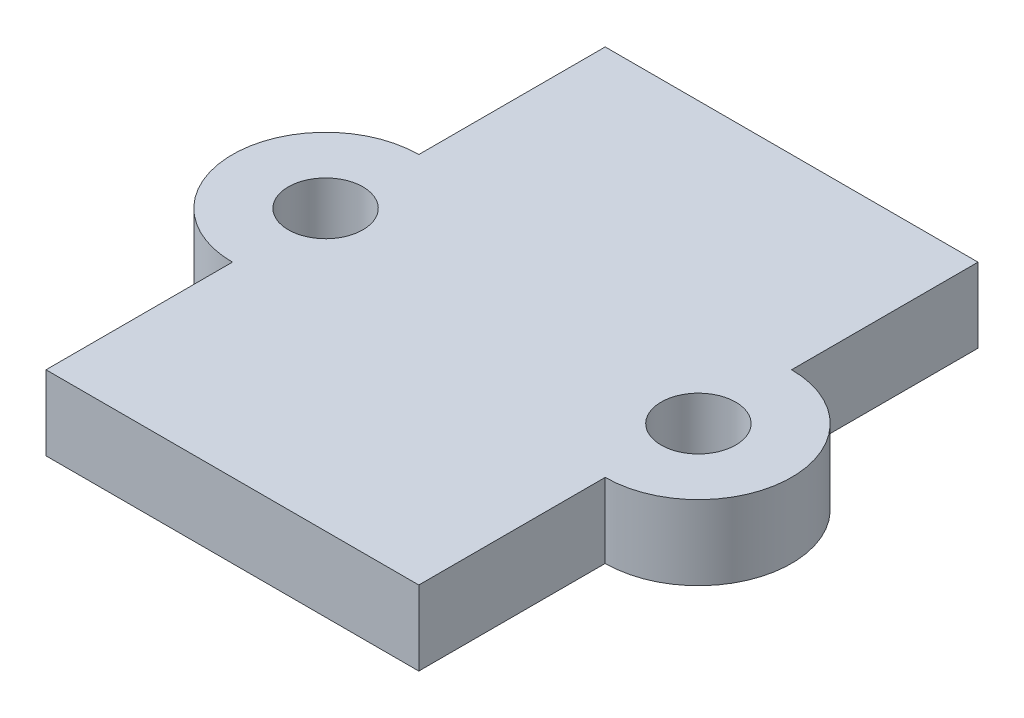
ISO-10303-21;
HEADER;
FILE_DESCRIPTION(('STEP AP214'),'2;1');
FILE_NAME('part.step','',(''),(''),'','','');
FILE_SCHEMA(('AUTOMOTIVE_DESIGN { 1 0 10303 214 1 1 1 1 }'));
ENDSEC;
DATA;
#1=APPLICATION_CONTEXT('core data for automotive mechanical design processes');
#2=APPLICATION_PROTOCOL_DEFINITION('international standard','automotive_design',2000,#1);
#3=PRODUCT_CONTEXT('',#1,'mechanical');
#4=PRODUCT('Part','Part','',(#3));
#5=PRODUCT_RELATED_PRODUCT_CATEGORY('part','',(#4));
#6=PRODUCT_DEFINITION_FORMATION('','',#4);
#7=PRODUCT_DEFINITION_CONTEXT('part definition',#1,'design');
#8=PRODUCT_DEFINITION('design','',#6,#7);
#9=PRODUCT_DEFINITION_SHAPE('','',#8);
#10=(LENGTH_UNIT() NAMED_UNIT(*) SI_UNIT(.MILLI.,.METRE.));
#11=(NAMED_UNIT(*) PLANE_ANGLE_UNIT() SI_UNIT($,.RADIAN.));
#12=(NAMED_UNIT(*) SI_UNIT($,.STERADIAN.) SOLID_ANGLE_UNIT());
#13=UNCERTAINTY_MEASURE_WITH_UNIT(LENGTH_MEASURE(1.E-05),#10,'distance_accuracy_value','');
#14=(GEOMETRIC_REPRESENTATION_CONTEXT(3) GLOBAL_UNCERTAINTY_ASSIGNED_CONTEXT((#13)) GLOBAL_UNIT_ASSIGNED_CONTEXT((#10,
#11,#12)) REPRESENTATION_CONTEXT('',''));
#15=CARTESIAN_POINT('',(0.,0.,0.));
#16=DIRECTION('',(0.,0.,1.));
#17=DIRECTION('',(1.,0.,0.));
#18=AXIS2_PLACEMENT_3D('',#15,#16,#17);
#19=CARTESIAN_POINT('',(4.99999999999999,2.,7.50000000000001));
#20=DIRECTION('',(-1.,0.,0.));
#21=DIRECTION('',(0.,0.,1.));
#22=AXIS2_PLACEMENT_3D('',#19,#20,#21);
#23=PLANE('',#22);
#24=DIRECTION('',(0.,0.,-1.));
#25=VECTOR('',#24,1.);
#26=CARTESIAN_POINT('',(4.99999999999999,2.,7.50000000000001));
#27=LINE('',#26,#25);
#28=CARTESIAN_POINT('',(4.99999999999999,2.,-2.5));
#29=VERTEX_POINT('',#28);
#30=CARTESIAN_POINT('',(4.99999999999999,2.,-7.49999999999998));
#31=VERTEX_POINT('',#30);
#32=EDGE_CURVE('E129',#29,#31,#27,.T.);
#33=ORIENTED_EDGE('',*,*,#32,.F.);
#34=DIRECTION('',(0.,1.,0.));
#35=VECTOR('',#34,1.);
#36=CARTESIAN_POINT('',(5.00000000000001,0.,-2.5));
#37=LINE('',#36,#35);
#38=CARTESIAN_POINT('',(5.00000000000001,0.,-2.5));
#39=VERTEX_POINT('',#38);
#40=EDGE_CURVE('E153',#39,#29,#37,.T.);
#41=ORIENTED_EDGE('',*,*,#40,.F.);
#42=DIRECTION('',(0.,0.,-1.));
#43=VECTOR('',#42,1.);
#44=CARTESIAN_POINT('',(4.99999999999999,0.,7.50000000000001));
#45=LINE('',#44,#43);
#46=CARTESIAN_POINT('',(4.99999999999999,0.,-7.49999999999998));
#47=VERTEX_POINT('',#46);
#48=EDGE_CURVE('E146',#39,#47,#45,.T.);
#49=ORIENTED_EDGE('',*,*,#48,.T.);
#50=DIRECTION('',(0.,-1.,0.));
#51=VECTOR('',#50,1.);
#52=CARTESIAN_POINT('',(4.99999999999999,2.,-7.49999999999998));
#53=LINE('',#52,#51);
#54=EDGE_CURVE('E11',#31,#47,#53,.T.);
#55=ORIENTED_EDGE('',*,*,#54,.F.);
#56=EDGE_LOOP('',(#33,#41,#49,#55));
#57=FACE_BOUND('',#56,.T.);
#58=ADVANCED_FACE('F33',(#57),#23,.F.);
#59=CARTESIAN_POINT('',(-5.00000000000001,2.,7.50000000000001));
#60=DIRECTION('',(1.,0.,0.));
#61=DIRECTION('',(0.,0.,-1.));
#62=AXIS2_PLACEMENT_3D('',#59,#60,#61);
#63=PLANE('',#62);
#64=DIRECTION('',(0.,1.,0.));
#65=VECTOR('',#64,1.);
#66=CARTESIAN_POINT('',(-5.00000000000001,0.,-2.5));
#67=LINE('',#66,#65);
#68=CARTESIAN_POINT('',(-5.00000000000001,0.,-2.5));
#69=VERTEX_POINT('',#68);
#70=CARTESIAN_POINT('',(-5.00000000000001,2.,-2.5));
#71=VERTEX_POINT('',#70);
#72=EDGE_CURVE('E102',#69,#71,#67,.T.);
#73=ORIENTED_EDGE('',*,*,#72,.T.);
#74=DIRECTION('',(0.,0.,1.));
#75=VECTOR('',#74,1.);
#76=CARTESIAN_POINT('',(-5.00000000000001,2.,7.50000000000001));
#77=LINE('',#76,#75);
#78=CARTESIAN_POINT('',(-5.00000000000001,2.,-7.49999999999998));
#79=VERTEX_POINT('',#78);
#80=EDGE_CURVE('E140',#79,#71,#77,.T.);
#81=ORIENTED_EDGE('',*,*,#80,.F.);
#82=DIRECTION('',(0.,-1.,0.));
#83=VECTOR('',#82,1.);
#84=CARTESIAN_POINT('',(-5.00000000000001,2.,-7.49999999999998));
#85=LINE('',#84,#83);
#86=CARTESIAN_POINT('',(-5.00000000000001,0.,-7.49999999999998));
#87=VERTEX_POINT('',#86);
#88=EDGE_CURVE('E41',#79,#87,#85,.T.);
#89=ORIENTED_EDGE('',*,*,#88,.T.);
#90=DIRECTION('',(0.,0.,1.));
#91=VECTOR('',#90,1.);
#92=CARTESIAN_POINT('',(-5.00000000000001,0.,7.50000000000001));
#93=LINE('',#92,#91);
#94=EDGE_CURVE('E121',#87,#69,#93,.T.);
#95=ORIENTED_EDGE('',*,*,#94,.T.);
#96=EDGE_LOOP('',(#73,#81,#89,#95));
#97=FACE_BOUND('',#96,.T.);
#98=ADVANCED_FACE('F139',(#97),#63,.F.);
#99=CARTESIAN_POINT('',(4.99999999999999,0.,7.50000000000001));
#100=VERTEX_POINT('',#99);
#101=CARTESIAN_POINT('',(5.00000000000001,0.,2.5));
#102=VERTEX_POINT('',#101);
#103=EDGE_CURVE('E124',#100,#102,#45,.T.);
#104=ORIENTED_EDGE('',*,*,#103,.T.);
#105=DIRECTION('',(0.,1.,0.));
#106=VECTOR('',#105,1.);
#107=CARTESIAN_POINT('',(5.00000000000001,0.,2.5));
#108=LINE('',#107,#106);
#109=CARTESIAN_POINT('',(5.00000000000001,2.,2.5));
#110=VERTEX_POINT('',#109);
#111=EDGE_CURVE('E115',#102,#110,#108,.T.);
#112=ORIENTED_EDGE('',*,*,#111,.T.);
#113=CARTESIAN_POINT('',(4.99999999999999,2.,7.50000000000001));
#114=VERTEX_POINT('',#113);
#115=EDGE_CURVE('E160',#114,#110,#27,.T.);
#116=ORIENTED_EDGE('',*,*,#115,.F.);
#117=DIRECTION('',(0.,-1.,0.));
#118=VECTOR('',#117,1.);
#119=CARTESIAN_POINT('',(4.99999999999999,2.,7.50000000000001));
#120=LINE('',#119,#118);
#121=EDGE_CURVE('E130',#114,#100,#120,.T.);
#122=ORIENTED_EDGE('',*,*,#121,.T.);
#123=EDGE_LOOP('',(#104,#112,#116,#122));
#124=FACE_BOUND('',#123,.T.);
#125=ADVANCED_FACE('F35',(#124),#23,.F.);
#126=CARTESIAN_POINT('',(-5.00000000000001,2.,-7.49999999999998));
#127=DIRECTION('',(0.,0.,1.));
#128=DIRECTION('',(1.,0.,0.));
#129=AXIS2_PLACEMENT_3D('',#126,#127,#128);
#130=PLANE('',#129);
#131=DIRECTION('',(-1.,0.,0.));
#132=VECTOR('',#131,1.);
#133=CARTESIAN_POINT('',(-5.00000000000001,0.,-7.49999999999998));
#134=LINE('',#133,#132);
#135=EDGE_CURVE('E122',#47,#87,#134,.T.);
#136=ORIENTED_EDGE('',*,*,#135,.T.);
#137=ORIENTED_EDGE('',*,*,#88,.F.);
#138=DIRECTION('',(-1.,0.,0.));
#139=VECTOR('',#138,1.);
#140=CARTESIAN_POINT('',(-5.00000000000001,2.,-7.49999999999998));
#141=LINE('',#140,#139);
#142=EDGE_CURVE('E149',#31,#79,#141,.T.);
#143=ORIENTED_EDGE('',*,*,#142,.F.);
#144=ORIENTED_EDGE('',*,*,#54,.T.);
#145=EDGE_LOOP('',(#136,#137,#143,#144));
#146=FACE_BOUND('',#145,.T.);
#147=ADVANCED_FACE('F148',(#146),#130,.F.);
#148=CARTESIAN_POINT('',(-5.00000000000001,2.,2.5));
#149=VERTEX_POINT('',#148);
#150=CARTESIAN_POINT('',(-5.00000000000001,2.,7.50000000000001));
#151=VERTEX_POINT('',#150);
#152=EDGE_CURVE('E114',#149,#151,#77,.T.);
#153=ORIENTED_EDGE('',*,*,#152,.F.);
#154=DIRECTION('',(0.,1.,0.));
#155=VECTOR('',#154,1.);
#156=CARTESIAN_POINT('',(-5.00000000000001,0.,2.5));
#157=LINE('',#156,#155);
#158=CARTESIAN_POINT('',(-5.00000000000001,0.,2.5));
#159=VERTEX_POINT('',#158);
#160=EDGE_CURVE('E99',#159,#149,#157,.T.);
#161=ORIENTED_EDGE('',*,*,#160,.F.);
#162=CARTESIAN_POINT('',(-5.00000000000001,0.,7.50000000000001));
#163=VERTEX_POINT('',#162);
#164=EDGE_CURVE('E112',#159,#163,#93,.T.);
#165=ORIENTED_EDGE('',*,*,#164,.T.);
#166=DIRECTION('',(0.,-1.,0.));
#167=VECTOR('',#166,1.);
#168=CARTESIAN_POINT('',(-5.00000000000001,2.,7.50000000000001));
#169=LINE('',#168,#167);
#170=EDGE_CURVE('E133',#151,#163,#169,.T.);
#171=ORIENTED_EDGE('',*,*,#170,.F.);
#172=EDGE_LOOP('',(#153,#161,#165,#171));
#173=FACE_BOUND('',#172,.T.);
#174=ADVANCED_FACE('F110',(#173),#63,.F.);
#175=CARTESIAN_POINT('',(-5.00000000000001,2.,7.50000000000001));
#176=DIRECTION('',(0.,0.,-1.));
#177=DIRECTION('',(-1.,0.,0.));
#178=AXIS2_PLACEMENT_3D('',#175,#176,#177);
#179=PLANE('',#178);
#180=DIRECTION('',(1.,0.,0.));
#181=VECTOR('',#180,1.);
#182=CARTESIAN_POINT('',(-5.00000000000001,0.,7.50000000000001));
#183=LINE('',#182,#181);
#184=EDGE_CURVE('E120',#163,#100,#183,.T.);
#185=ORIENTED_EDGE('',*,*,#184,.T.);
#186=ORIENTED_EDGE('',*,*,#121,.F.);
#187=DIRECTION('',(1.,0.,0.));
#188=VECTOR('',#187,1.);
#189=CARTESIAN_POINT('',(-5.00000000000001,2.,7.50000000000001));
#190=LINE('',#189,#188);
#191=EDGE_CURVE('E134',#151,#114,#190,.T.);
#192=ORIENTED_EDGE('',*,*,#191,.F.);
#193=ORIENTED_EDGE('',*,*,#170,.T.);
#194=EDGE_LOOP('',(#185,#186,#192,#193));
#195=FACE_BOUND('',#194,.T.);
#196=ADVANCED_FACE('F220',(#195),#179,.F.);
#197=CARTESIAN_POINT('',(0.,2.,0.));
#198=DIRECTION('',(0.,-1.,0.));
#199=DIRECTION('',(0.,0.,-1.));
#200=AXIS2_PLACEMENT_3D('',#197,#198,#199);
#201=PLANE('',#200);
#202=CARTESIAN_POINT('',(5.00000000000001,2.,0.));
#203=DIRECTION('',(0.,-1.,0.));
#204=DIRECTION('',(0.,0.,-1.));
#205=AXIS2_PLACEMENT_3D('',#202,#203,#204);
#206=CIRCLE('',#205,1.);
#207=CARTESIAN_POINT('',(5.00000000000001,2.,-1.));
#208=VERTEX_POINT('',#207);
#209=EDGE_CURVE('E167',#208,#208,#206,.T.);
#210=ORIENTED_EDGE('',*,*,#209,.T.);
#211=EDGE_LOOP('',(#210));
#212=FACE_BOUND('',#211,.T.);
#213=CARTESIAN_POINT('',(-5.00000000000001,2.,0.));
#214=DIRECTION('',(0.,-1.,0.));
#215=DIRECTION('',(0.,0.,-1.));
#216=AXIS2_PLACEMENT_3D('',#213,#214,#215);
#217=CIRCLE('',#216,1.);
#218=CARTESIAN_POINT('',(-5.00000000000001,2.,-1.));
#219=VERTEX_POINT('',#218);
#220=EDGE_CURVE('E169',#219,#219,#217,.T.);
#221=ORIENTED_EDGE('',*,*,#220,.T.);
#222=EDGE_LOOP('',(#221));
#223=FACE_BOUND('',#222,.T.);
#224=ORIENTED_EDGE('',*,*,#115,.T.);
#225=CARTESIAN_POINT('',(5.00000000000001,2.,0.));
#226=DIRECTION('',(0.,1.,0.));
#227=DIRECTION('',(0.,0.,1.));
#228=AXIS2_PLACEMENT_3D('',#225,#226,#227);
#229=CIRCLE('',#228,2.5);
#230=EDGE_CURVE('E55',#110,#29,#229,.T.);
#231=ORIENTED_EDGE('',*,*,#230,.T.);
#232=ORIENTED_EDGE('',*,*,#32,.T.);
#233=ORIENTED_EDGE('',*,*,#142,.T.);
#234=ORIENTED_EDGE('',*,*,#80,.T.);
#235=CARTESIAN_POINT('',(-5.00000000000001,2.,0.));
#236=DIRECTION('',(0.,1.,0.));
#237=DIRECTION('',(0.,0.,1.));
#238=AXIS2_PLACEMENT_3D('',#235,#236,#237);
#239=CIRCLE('',#238,2.5);
#240=EDGE_CURVE('E48',#71,#149,#239,.T.);
#241=ORIENTED_EDGE('',*,*,#240,.T.);
#242=ORIENTED_EDGE('',*,*,#152,.T.);
#243=ORIENTED_EDGE('',*,*,#191,.T.);
#244=EDGE_LOOP('',(#224,#231,#232,#233,#234,#241,#242,#243));
#245=FACE_BOUND('',#244,.T.);
#246=ADVANCED_FACE('F181',(#212,#223,#245),#201,.F.);
#247=CARTESIAN_POINT('',(0.,0.,0.));
#248=DIRECTION('',(0.,-1.,0.));
#249=DIRECTION('',(0.,0.,-1.));
#250=AXIS2_PLACEMENT_3D('',#247,#248,#249);
#251=PLANE('',#250);
#252=CARTESIAN_POINT('',(5.00000000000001,0.,0.));
#253=DIRECTION('',(0.,-1.,0.));
#254=DIRECTION('',(0.,0.,-1.));
#255=AXIS2_PLACEMENT_3D('',#252,#253,#254);
#256=CIRCLE('',#255,1.);
#257=CARTESIAN_POINT('',(5.00000000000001,0.,-1.));
#258=VERTEX_POINT('',#257);
#259=EDGE_CURVE('E175',#258,#258,#256,.T.);
#260=ORIENTED_EDGE('',*,*,#259,.F.);
#261=EDGE_LOOP('',(#260));
#262=FACE_BOUND('',#261,.T.);
#263=CARTESIAN_POINT('',(-5.00000000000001,0.,0.));
#264=DIRECTION('',(0.,-1.,0.));
#265=DIRECTION('',(0.,0.,-1.));
#266=AXIS2_PLACEMENT_3D('',#263,#264,#265);
#267=CIRCLE('',#266,1.);
#268=CARTESIAN_POINT('',(-5.00000000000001,0.,-1.));
#269=VERTEX_POINT('',#268);
#270=EDGE_CURVE('E172',#269,#269,#267,.T.);
#271=ORIENTED_EDGE('',*,*,#270,.F.);
#272=EDGE_LOOP('',(#271));
#273=FACE_BOUND('',#272,.T.);
#274=ORIENTED_EDGE('',*,*,#164,.F.);
#275=CARTESIAN_POINT('',(-5.00000000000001,0.,0.));
#276=DIRECTION('',(0.,1.,0.));
#277=DIRECTION('',(0.,0.,1.));
#278=AXIS2_PLACEMENT_3D('',#275,#276,#277);
#279=CIRCLE('',#278,2.5);
#280=EDGE_CURVE('E96',#69,#159,#279,.T.);
#281=ORIENTED_EDGE('',*,*,#280,.F.);
#282=ORIENTED_EDGE('',*,*,#94,.F.);
#283=ORIENTED_EDGE('',*,*,#135,.F.);
#284=ORIENTED_EDGE('',*,*,#48,.F.);
#285=CARTESIAN_POINT('',(5.00000000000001,0.,0.));
#286=DIRECTION('',(0.,1.,0.));
#287=DIRECTION('',(0.,0.,1.));
#288=AXIS2_PLACEMENT_3D('',#285,#286,#287);
#289=CIRCLE('',#288,2.5);
#290=EDGE_CURVE('E107',#102,#39,#289,.T.);
#291=ORIENTED_EDGE('',*,*,#290,.F.);
#292=ORIENTED_EDGE('',*,*,#103,.F.);
#293=ORIENTED_EDGE('',*,*,#184,.F.);
#294=EDGE_LOOP('',(#274,#281,#282,#283,#284,#291,#292,#293));
#295=FACE_BOUND('',#294,.T.);
#296=ADVANCED_FACE('F118',(#262,#273,#295),#251,.T.);
#297=CARTESIAN_POINT('',(-5.00000000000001,0.,0.));
#298=DIRECTION('',(0.,1.,0.));
#299=DIRECTION('',(0.,0.,1.));
#300=AXIS2_PLACEMENT_3D('',#297,#298,#299);
#301=CYLINDRICAL_SURFACE('',#300,2.5);
#302=ORIENTED_EDGE('',*,*,#240,.F.);
#303=ORIENTED_EDGE('',*,*,#72,.F.);
#304=ORIENTED_EDGE('',*,*,#280,.T.);
#305=ORIENTED_EDGE('',*,*,#160,.T.);
#306=EDGE_LOOP('',(#302,#303,#304,#305));
#307=FACE_BOUND('',#306,.T.);
#308=ADVANCED_FACE('F98',(#307),#301,.T.);
#309=CARTESIAN_POINT('',(5.00000000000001,0.,0.));
#310=DIRECTION('',(0.,1.,0.));
#311=DIRECTION('',(0.,0.,1.));
#312=AXIS2_PLACEMENT_3D('',#309,#310,#311);
#313=CYLINDRICAL_SURFACE('',#312,2.5);
#314=ORIENTED_EDGE('',*,*,#230,.F.);
#315=ORIENTED_EDGE('',*,*,#111,.F.);
#316=ORIENTED_EDGE('',*,*,#290,.T.);
#317=ORIENTED_EDGE('',*,*,#40,.T.);
#318=EDGE_LOOP('',(#314,#315,#316,#317));
#319=FACE_BOUND('',#318,.T.);
#320=ADVANCED_FACE('F197',(#319),#313,.T.);
#321=CARTESIAN_POINT('',(-5.00000000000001,2.,0.));
#322=DIRECTION('',(0.,-1.,0.));
#323=DIRECTION('',(0.,0.,-1.));
#324=AXIS2_PLACEMENT_3D('',#321,#322,#323);
#325=CYLINDRICAL_SURFACE('',#324,1.);
#326=ORIENTED_EDGE('',*,*,#220,.F.);
#327=EDGE_LOOP('',(#326));
#328=FACE_BOUND('',#327,.T.);
#329=ORIENTED_EDGE('',*,*,#270,.T.);
#330=EDGE_LOOP('',(#329));
#331=FACE_BOUND('',#330,.T.);
#332=ADVANCED_FACE('F187',(#328,#331),#325,.F.);
#333=CARTESIAN_POINT('',(5.00000000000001,2.,0.));
#334=DIRECTION('',(0.,-1.,0.));
#335=DIRECTION('',(0.,0.,-1.));
#336=AXIS2_PLACEMENT_3D('',#333,#334,#335);
#337=CYLINDRICAL_SURFACE('',#336,1.);
#338=ORIENTED_EDGE('',*,*,#209,.F.);
#339=EDGE_LOOP('',(#338));
#340=FACE_BOUND('',#339,.T.);
#341=ORIENTED_EDGE('',*,*,#259,.T.);
#342=EDGE_LOOP('',(#341));
#343=FACE_BOUND('',#342,.T.);
#344=ADVANCED_FACE('F184',(#340,#343),#337,.F.);
#345=CLOSED_SHELL('',(#58,#98,#125,#147,#174,#196,#246,#296,#308,#320,#332,#344));
#346=MANIFOLD_SOLID_BREP('B2',#345);
#347=ADVANCED_BREP_SHAPE_REPRESENTATION('',(#18,#346),#14);
#348=SHAPE_DEFINITION_REPRESENTATION(#9,#347);
ENDSEC;
END-ISO-10303-21;
